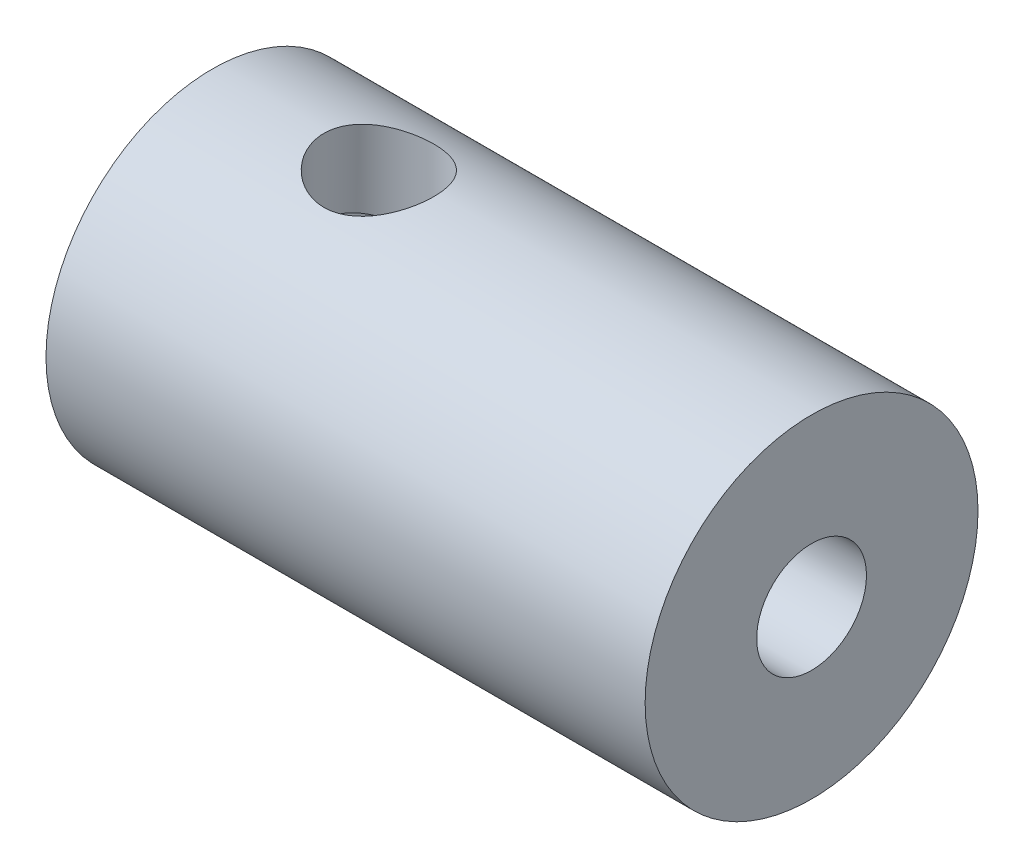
ISO-10303-21;
HEADER;
FILE_DESCRIPTION(('STEP AP214'),'2;1');
FILE_NAME('part.step','',(''),(''),'','','');
FILE_SCHEMA(('AUTOMOTIVE_DESIGN { 1 0 10303 214 1 1 1 1 }'));
ENDSEC;
DATA;
#1=APPLICATION_CONTEXT('core data for automotive mechanical design processes');
#2=APPLICATION_PROTOCOL_DEFINITION('international standard','automotive_design',2000,#1);
#3=PRODUCT_CONTEXT('',#1,'mechanical');
#4=PRODUCT('Part','Part','',(#3));
#5=PRODUCT_RELATED_PRODUCT_CATEGORY('part','',(#4));
#6=PRODUCT_DEFINITION_FORMATION('','',#4);
#7=PRODUCT_DEFINITION_CONTEXT('part definition',#1,'design');
#8=PRODUCT_DEFINITION('design','',#6,#7);
#9=PRODUCT_DEFINITION_SHAPE('','',#8);
#10=(LENGTH_UNIT() NAMED_UNIT(*) SI_UNIT(.MILLI.,.METRE.));
#11=(NAMED_UNIT(*) PLANE_ANGLE_UNIT() SI_UNIT($,.RADIAN.));
#12=(NAMED_UNIT(*) SI_UNIT($,.STERADIAN.) SOLID_ANGLE_UNIT());
#13=UNCERTAINTY_MEASURE_WITH_UNIT(LENGTH_MEASURE(1.E-05),#10,'distance_accuracy_value','');
#14=(GEOMETRIC_REPRESENTATION_CONTEXT(3) GLOBAL_UNCERTAINTY_ASSIGNED_CONTEXT((#13)) GLOBAL_UNIT_ASSIGNED_CONTEXT((#10,
#11,#12)) REPRESENTATION_CONTEXT('',''));
#15=CARTESIAN_POINT('',(0.,0.,0.));
#16=DIRECTION('',(0.,0.,1.));
#17=DIRECTION('',(1.,0.,0.));
#18=AXIS2_PLACEMENT_3D('',#15,#16,#17);
#19=CARTESIAN_POINT('',(18.,0.,0.));
#20=DIRECTION('',(-1.,0.,0.));
#21=DIRECTION('',(0.,0.,1.));
#22=AXIS2_PLACEMENT_3D('',#19,#20,#21);
#23=CYLINDRICAL_SURFACE('',#22,5.);
#24=CARTESIAN_POINT('',(5.,-4.71990466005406,1.64999999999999));
#25=CARTESIAN_POINT('',(5.08992939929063,-4.71990452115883,1.65000024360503));
#26=CARTESIAN_POINT('',(5.17985768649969,-4.72250292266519,1.64262303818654));
#27=CARTESIAN_POINT('',(5.35705367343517,-4.73256311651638,1.61340616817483));
#28=CARTESIAN_POINT('',(5.44432088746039,-4.74002579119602,1.59156387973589));
#29=CARTESIAN_POINT('',(5.61359969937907,-4.75887919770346,1.53426465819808));
#30=CARTESIAN_POINT('',(5.69562107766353,-4.77026235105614,1.49883397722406));
#31=CARTESIAN_POINT('',(5.8525814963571,-4.79566317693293,1.41545303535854));
#32=CARTESIAN_POINT('',(5.92751901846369,-4.80968141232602,1.36750009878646));
#33=CARTESIAN_POINT('',(6.07105763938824,-4.83937566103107,1.25846654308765));
#34=CARTESIAN_POINT('',(6.13934748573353,-4.85509238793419,1.1969871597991));
#35=CARTESIAN_POINT('',(6.26485926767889,-4.88606822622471,1.06349727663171));
#36=CARTESIAN_POINT('',(6.322079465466,-4.90132726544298,0.991485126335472));
#37=CARTESIAN_POINT('',(6.42523358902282,-4.93013890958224,0.836704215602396));
#38=CARTESIAN_POINT('',(6.47084230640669,-4.94363804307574,0.75370788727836));
#39=CARTESIAN_POINT('',(6.54732873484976,-4.9669298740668,0.580699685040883));
#40=CARTESIAN_POINT('',(6.57821033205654,-4.97672354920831,0.490689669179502));
#41=CARTESIAN_POINT('',(6.62331307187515,-4.99121262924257,0.309471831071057));
#42=CARTESIAN_POINT('',(6.63806721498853,-4.99607073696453,0.218409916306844));
#43=CARTESIAN_POINT('',(6.65218999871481,-5.00071837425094,0.0349820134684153));
#44=CARTESIAN_POINT('',(6.65156252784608,-5.00050918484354,-0.0573836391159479));
#45=CARTESIAN_POINT('',(6.63528002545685,-4.99515654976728,-0.237027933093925));
#46=CARTESIAN_POINT('',(6.6202037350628,-4.99020313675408,-0.324365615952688));
#47=CARTESIAN_POINT('',(6.5764073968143,-4.9761564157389,-0.49519357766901));
#48=CARTESIAN_POINT('',(6.54768642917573,-4.96706282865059,-0.578683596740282));
#49=CARTESIAN_POINT('',(6.47707262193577,-4.94551338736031,-0.740723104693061));
#50=CARTESIAN_POINT('',(6.43501331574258,-4.93301533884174,-0.819194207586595));
#51=CARTESIAN_POINT('',(6.33905332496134,-4.90596050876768,-0.968137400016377));
#52=CARTESIAN_POINT('',(6.28514939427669,-4.89140316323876,-1.03860728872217));
#53=CARTESIAN_POINT('',(6.16410482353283,-4.86097294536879,-1.1729917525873));
#54=CARTESIAN_POINT('',(6.09646769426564,-4.84507036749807,-1.23645304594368));
#55=CARTESIAN_POINT('',(5.95137341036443,-4.81431124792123,-1.35127700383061));
#56=CARTESIAN_POINT('',(5.87391480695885,-4.79945486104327,-1.4026378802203));
#57=CARTESIAN_POINT('',(5.70996560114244,-4.77230967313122,-1.49241382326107));
#58=CARTESIAN_POINT('',(5.62336561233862,-4.76005891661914,-1.53064150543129));
#59=CARTESIAN_POINT('',(5.44445239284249,-4.73995346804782,-1.59181981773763));
#60=CARTESIAN_POINT('',(5.35214151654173,-4.73209697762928,-1.61477669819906));
#61=CARTESIAN_POINT('',(5.16880983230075,-4.72207527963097,-1.6438468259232));
#62=CARTESIAN_POINT('',(5.0779131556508,-4.71967327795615,-1.65066145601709));
#63=CARTESIAN_POINT('',(4.89626215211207,-4.7201713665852,-1.64923749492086));
#64=CARTESIAN_POINT('',(4.80550780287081,-4.72307051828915,-1.64100156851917));
#65=CARTESIAN_POINT('',(4.62987992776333,-4.73360855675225,-1.61033997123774));
#66=CARTESIAN_POINT('',(4.54491123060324,-4.74108573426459,-1.5883979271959));
#67=CARTESIAN_POINT('',(4.37987739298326,-4.75976051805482,-1.53152522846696));
#68=CARTESIAN_POINT('',(4.2998131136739,-4.77095877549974,-1.49659230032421));
#69=CARTESIAN_POINT('',(4.14408997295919,-4.79624726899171,-1.41348842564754));
#70=CARTESIAN_POINT('',(4.06864683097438,-4.81041691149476,-1.36493806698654));
#71=CARTESIAN_POINT('',(3.92672439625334,-4.83989585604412,-1.25640957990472));
#72=CARTESIAN_POINT('',(3.86024770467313,-4.85520548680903,-1.19642814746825));
#73=CARTESIAN_POINT('',(3.73491681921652,-4.88610989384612,-1.06339123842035));
#74=CARTESIAN_POINT('',(3.67656776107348,-4.90168425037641,-0.989853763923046));
#75=CARTESIAN_POINT('',(3.57300735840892,-4.93065204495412,-0.833649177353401));
#76=CARTESIAN_POINT('',(3.52779552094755,-4.94404556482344,-0.750982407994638));
#77=CARTESIAN_POINT('',(3.45221100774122,-4.96707750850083,-0.579295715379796));
#78=CARTESIAN_POINT('',(3.42173954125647,-4.976740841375,-0.490322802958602));
#79=CARTESIAN_POINT('',(3.37631330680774,-4.99133146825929,-0.308134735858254));
#80=CARTESIAN_POINT('',(3.36135306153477,-4.99626043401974,-0.214921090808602));
#81=CARTESIAN_POINT('',(3.34785918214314,-5.00070328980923,-0.0315225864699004));
#82=CARTESIAN_POINT('',(3.34859968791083,-5.00045646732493,0.0586036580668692));
#83=CARTESIAN_POINT('',(3.36470152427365,-4.99516201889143,0.23738802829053));
#84=CARTESIAN_POINT('',(3.38006170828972,-4.99011476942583,0.326046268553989));
#85=CARTESIAN_POINT('',(3.42448830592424,-4.97587240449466,0.498029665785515));
#86=CARTESIAN_POINT('',(3.45334133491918,-4.96674195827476,0.581415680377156));
#87=CARTESIAN_POINT('',(3.52373789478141,-4.94527347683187,0.742196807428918));
#88=CARTESIAN_POINT('',(3.56528370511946,-4.93293486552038,0.819590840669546));
#89=CARTESIAN_POINT('',(3.66163265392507,-4.90576374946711,0.969268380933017));
#90=CARTESIAN_POINT('',(3.71686414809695,-4.8908566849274,1.04126244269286));
#91=CARTESIAN_POINT('',(3.8382836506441,-4.86041514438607,1.17519818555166));
#92=CARTESIAN_POINT('',(3.90447511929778,-4.84488047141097,1.23713667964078));
#93=CARTESIAN_POINT('',(4.04895585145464,-4.81423121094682,1.35160179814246));
#94=CARTESIAN_POINT('',(4.12761026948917,-4.79915525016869,1.40367929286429));
#95=CARTESIAN_POINT('',(4.29302166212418,-4.77186368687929,1.49383628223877));
#96=CARTESIAN_POINT('',(4.37977631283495,-4.759647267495,1.5319197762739));
#97=CARTESIAN_POINT('',(4.55434327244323,-4.74014636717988,1.59120734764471));
#98=CARTESIAN_POINT('',(4.64186804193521,-4.7326392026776,1.61318355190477));
#99=CARTESIAN_POINT('',(4.81959617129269,-4.7225192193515,1.64257737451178));
#100=CARTESIAN_POINT('',(4.90979864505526,-4.71990479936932,1.64999975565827));
#101=CARTESIAN_POINT('',(5.,-4.71990466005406,1.64999999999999));
#102=B_SPLINE_CURVE_WITH_KNOTS('',3,(#24,#25,#26,#27,#28,#29,#30,#31,#32,#33,#34,#35,#36,#37,
#38,#39,#40,#41,#42,#43,#44,#45,#46,#47,#48,#49,#50,#51,#52,#53,#54,#55,#56,#57,#58,#59,#60,#61,
#62,#63,#64,#65,#66,#67,#68,#69,#70,#71,#72,#73,#74,#75,#76,#77,#78,#79,#80,#81,#82,#83,#84,#85,
#86,#87,#88,#89,#90,#91,#92,#93,#94,#95,#96,#97,#98,#99,#100,#101),.UNSPECIFIED.,.T.,.F.,(4,2,2,
2,2,2,2,2,2,2,2,2,2,2,2,2,2,2,2,2,2,2,2,2,2,2,2,2,2,2,2,2,2,2,2,2,2,2,4),(0.,0.269454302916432,
0.538957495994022,0.807942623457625,1.07698527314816,1.35539043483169,1.63383926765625,
1.91939248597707,2.20487031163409,2.48059787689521,2.75625573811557,3.02131448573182,
3.28639110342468,3.55491555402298,3.82351368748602,4.10452131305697,4.38557043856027,
4.67047751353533,4.95526790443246,5.22743703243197,5.49955797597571,5.76258081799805,
6.02564971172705,6.29693565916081,6.56830013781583,6.85241935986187,7.13652791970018,
7.41870503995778,7.70078248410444,7.96984890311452,8.23889422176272,8.50382155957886,
8.76879650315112,9.04343817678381,9.3181667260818,9.60337461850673,9.8885009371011,
10.1588585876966,10.4291277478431),.UNSPECIFIED.);
#103=CARTESIAN_POINT('',(5.,-4.71990466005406,1.64999999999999));
#104=VERTEX_POINT('',#103);
#105=EDGE_CURVE('E51',#104,#104,#102,.T.);
#106=ORIENTED_EDGE('',*,*,#105,.T.);
#107=EDGE_LOOP('',(#106));
#108=FACE_BOUND('',#107,.T.);
#109=CARTESIAN_POINT('',(5.,4.71990466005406,1.64999999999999));
#110=CARTESIAN_POINT('',(4.91007060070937,4.71990452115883,1.65000024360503));
#111=CARTESIAN_POINT('',(4.82014231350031,4.72250292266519,1.64262303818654));
#112=CARTESIAN_POINT('',(4.64294632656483,4.73256311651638,1.61340616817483));
#113=CARTESIAN_POINT('',(4.55567911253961,4.74002579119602,1.59156387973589));
#114=CARTESIAN_POINT('',(4.38640030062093,4.75887919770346,1.53426465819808));
#115=CARTESIAN_POINT('',(4.30437892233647,4.77026235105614,1.49883397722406));
#116=CARTESIAN_POINT('',(4.1474185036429,4.79566317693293,1.41545303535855));
#117=CARTESIAN_POINT('',(4.07248098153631,4.80968141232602,1.36750009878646));
#118=CARTESIAN_POINT('',(3.92894236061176,4.83937566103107,1.25846654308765));
#119=CARTESIAN_POINT('',(3.86065251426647,4.85509238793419,1.1969871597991));
#120=CARTESIAN_POINT('',(3.73514073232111,4.88606822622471,1.06349727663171));
#121=CARTESIAN_POINT('',(3.677920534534,4.90132726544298,0.991485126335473));
#122=CARTESIAN_POINT('',(3.57476641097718,4.93013890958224,0.836704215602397));
#123=CARTESIAN_POINT('',(3.52915769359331,4.94363804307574,0.753707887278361));
#124=CARTESIAN_POINT('',(3.45267126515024,4.9669298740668,0.580699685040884));
#125=CARTESIAN_POINT('',(3.42178966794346,4.97672354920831,0.490689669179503));
#126=CARTESIAN_POINT('',(3.37668692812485,4.99121262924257,0.309471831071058));
#127=CARTESIAN_POINT('',(3.36193278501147,4.99607073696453,0.218409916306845));
#128=CARTESIAN_POINT('',(3.34781000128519,5.00071837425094,0.0349820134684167));
#129=CARTESIAN_POINT('',(3.34843747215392,5.00050918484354,-0.0573836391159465));
#130=CARTESIAN_POINT('',(3.36471997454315,4.99515654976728,-0.237027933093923));
#131=CARTESIAN_POINT('',(3.3797962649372,4.99020313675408,-0.324365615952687));
#132=CARTESIAN_POINT('',(3.4235926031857,4.9761564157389,-0.495193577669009));
#133=CARTESIAN_POINT('',(3.45231357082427,4.96706282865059,-0.578683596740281));
#134=CARTESIAN_POINT('',(3.52292737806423,4.94551338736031,-0.74072310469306));
#135=CARTESIAN_POINT('',(3.56498668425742,4.93301533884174,-0.819194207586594));
#136=CARTESIAN_POINT('',(3.66094667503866,4.90596050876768,-0.968137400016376));
#137=CARTESIAN_POINT('',(3.71485060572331,4.89140316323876,-1.03860728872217));
#138=CARTESIAN_POINT('',(3.83589517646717,4.86097294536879,-1.1729917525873));
#139=CARTESIAN_POINT('',(3.90353230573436,4.84507036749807,-1.23645304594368));
#140=CARTESIAN_POINT('',(4.04862658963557,4.81431124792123,-1.35127700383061));
#141=CARTESIAN_POINT('',(4.12608519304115,4.79945486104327,-1.40263788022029));
#142=CARTESIAN_POINT('',(4.29003439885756,4.77230967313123,-1.49241382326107));
#143=CARTESIAN_POINT('',(4.37663438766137,4.76005891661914,-1.53064150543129));
#144=CARTESIAN_POINT('',(4.55554760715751,4.73995346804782,-1.59181981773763));
#145=CARTESIAN_POINT('',(4.64785848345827,4.73209697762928,-1.61477669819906));
#146=CARTESIAN_POINT('',(4.83119016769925,4.72207527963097,-1.6438468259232));
#147=CARTESIAN_POINT('',(4.92208684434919,4.71967327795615,-1.65066145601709));
#148=CARTESIAN_POINT('',(5.10373784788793,4.7201713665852,-1.64923749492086));
#149=CARTESIAN_POINT('',(5.19449219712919,4.72307051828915,-1.64100156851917));
#150=CARTESIAN_POINT('',(5.37012007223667,4.73360855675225,-1.61033997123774));
#151=CARTESIAN_POINT('',(5.45508876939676,4.74108573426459,-1.5883979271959));
#152=CARTESIAN_POINT('',(5.62012260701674,4.75976051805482,-1.53152522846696));
#153=CARTESIAN_POINT('',(5.7001868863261,4.77095877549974,-1.49659230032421));
#154=CARTESIAN_POINT('',(5.85591002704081,4.79624726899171,-1.41348842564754));
#155=CARTESIAN_POINT('',(5.93135316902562,4.81041691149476,-1.36493806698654));
#156=CARTESIAN_POINT('',(6.07327560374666,4.83989585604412,-1.25640957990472));
#157=CARTESIAN_POINT('',(6.13975229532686,4.85520548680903,-1.19642814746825));
#158=CARTESIAN_POINT('',(6.26508318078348,4.88610989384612,-1.06339123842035));
#159=CARTESIAN_POINT('',(6.32343223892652,4.90168425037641,-0.989853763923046));
#160=CARTESIAN_POINT('',(6.42699264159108,4.93065204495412,-0.833649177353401));
#161=CARTESIAN_POINT('',(6.47220447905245,4.94404556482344,-0.750982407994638));
#162=CARTESIAN_POINT('',(6.54778899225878,4.96707750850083,-0.579295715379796));
#163=CARTESIAN_POINT('',(6.57826045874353,4.976740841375,-0.490322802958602));
#164=CARTESIAN_POINT('',(6.62368669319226,4.99133146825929,-0.308134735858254));
#165=CARTESIAN_POINT('',(6.63864693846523,4.99626043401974,-0.214921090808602));
#166=CARTESIAN_POINT('',(6.65214081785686,5.00070328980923,-0.0315225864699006));
#167=CARTESIAN_POINT('',(6.65140031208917,5.00045646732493,0.0586036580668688));
#168=CARTESIAN_POINT('',(6.63529847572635,4.99516201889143,0.23738802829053));
#169=CARTESIAN_POINT('',(6.61993829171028,4.99011476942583,0.326046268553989));
#170=CARTESIAN_POINT('',(6.57551169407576,4.97587240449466,0.498029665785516));
#171=CARTESIAN_POINT('',(6.54665866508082,4.96674195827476,0.581415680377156));
#172=CARTESIAN_POINT('',(6.47626210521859,4.94527347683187,0.742196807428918));
#173=CARTESIAN_POINT('',(6.43471629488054,4.93293486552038,0.819590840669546));
#174=CARTESIAN_POINT('',(6.33836734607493,4.90576374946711,0.969268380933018));
#175=CARTESIAN_POINT('',(6.28313585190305,4.8908566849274,1.04126244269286));
#176=CARTESIAN_POINT('',(6.1617163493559,4.86041514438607,1.17519818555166));
#177=CARTESIAN_POINT('',(6.09552488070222,4.84488047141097,1.23713667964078));
#178=CARTESIAN_POINT('',(5.95104414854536,4.81423121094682,1.35160179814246));
#179=CARTESIAN_POINT('',(5.87238973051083,4.79915525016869,1.40367929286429));
#180=CARTESIAN_POINT('',(5.70697833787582,4.77186368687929,1.49383628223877));
#181=CARTESIAN_POINT('',(5.62022368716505,4.759647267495,1.5319197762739));
#182=CARTESIAN_POINT('',(5.44565672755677,4.74014636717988,1.59120734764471));
#183=CARTESIAN_POINT('',(5.35813195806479,4.7326392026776,1.61318355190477));
#184=CARTESIAN_POINT('',(5.18040382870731,4.7225192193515,1.64257737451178));
#185=CARTESIAN_POINT('',(5.09020135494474,4.71990479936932,1.64999975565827));
#186=CARTESIAN_POINT('',(5.,4.71990466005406,1.64999999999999));
#187=B_SPLINE_CURVE_WITH_KNOTS('',3,(#109,#110,#111,#112,#113,#114,#115,#116,#117,#118,#119,
#120,#121,#122,#123,#124,#125,#126,#127,#128,#129,#130,#131,#132,#133,#134,#135,#136,#137,#138,
#139,#140,#141,#142,#143,#144,#145,#146,#147,#148,#149,#150,#151,#152,#153,#154,#155,#156,#157,
#158,#159,#160,#161,#162,#163,#164,#165,#166,#167,#168,#169,#170,#171,#172,#173,#174,#175,#176,
#177,#178,#179,#180,#181,#182,#183,#184,#185,#186),.UNSPECIFIED.,.T.,.F.,(4,2,2,2,2,2,2,2,2,2,2,
2,2,2,2,2,2,2,2,2,2,2,2,2,2,2,2,2,2,2,2,2,2,2,2,2,2,2,4),(0.,0.269454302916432,
0.538957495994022,0.807942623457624,1.07698527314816,1.35539043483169,1.63383926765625,
1.91939248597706,2.20487031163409,2.48059787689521,2.75625573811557,3.02131448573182,
3.28639110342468,3.55491555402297,3.82351368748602,4.10452131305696,4.38557043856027,
4.67047751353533,4.95526790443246,5.22743703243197,5.49955797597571,5.76258081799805,
6.02564971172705,6.29693565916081,6.56830013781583,6.85241935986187,7.13652791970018,
7.41870503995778,7.70078248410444,7.96984890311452,8.23889422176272,8.50382155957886,
8.76879650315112,9.04343817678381,9.3181667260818,9.60337461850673,9.8885009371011,
10.1588585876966,10.4291277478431),.UNSPECIFIED.);
#188=CARTESIAN_POINT('',(5.,4.71990466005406,1.64999999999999));
#189=VERTEX_POINT('',#188);
#190=EDGE_CURVE('E12',#189,#189,#187,.T.);
#191=ORIENTED_EDGE('',*,*,#190,.T.);
#192=EDGE_LOOP('',(#191));
#193=FACE_BOUND('',#192,.T.);
#194=CARTESIAN_POINT('',(18.,0.,0.));
#195=DIRECTION('',(1.,0.,0.));
#196=DIRECTION('',(0.,0.,-1.));
#197=AXIS2_PLACEMENT_3D('',#194,#195,#196);
#198=CIRCLE('',#197,5.);
#199=CARTESIAN_POINT('',(18.,0.,-5.));
#200=VERTEX_POINT('',#199);
#201=EDGE_CURVE('E58',#200,#200,#198,.T.);
#202=ORIENTED_EDGE('',*,*,#201,.F.);
#203=EDGE_LOOP('',(#202));
#204=FACE_BOUND('',#203,.T.);
#205=CARTESIAN_POINT('',(0.,0.,0.));
#206=DIRECTION('',(1.,0.,0.));
#207=DIRECTION('',(0.,0.,-1.));
#208=AXIS2_PLACEMENT_3D('',#205,#206,#207);
#209=CIRCLE('',#208,5.);
#210=CARTESIAN_POINT('',(0.,0.,-5.));
#211=VERTEX_POINT('',#210);
#212=EDGE_CURVE('E62',#211,#211,#209,.T.);
#213=ORIENTED_EDGE('',*,*,#212,.T.);
#214=EDGE_LOOP('',(#213));
#215=FACE_BOUND('',#214,.T.);
#216=ADVANCED_FACE('F47',(#108,#193,#204,#215),#23,.T.);
#217=CARTESIAN_POINT('',(18.,0.,0.));
#218=DIRECTION('',(1.,0.,0.));
#219=DIRECTION('',(0.,0.,-1.));
#220=AXIS2_PLACEMENT_3D('',#217,#218,#219);
#221=PLANE('',#220);
#222=CARTESIAN_POINT('',(18.,0.,0.));
#223=DIRECTION('',(1.,0.,0.));
#224=DIRECTION('',(0.,0.,-1.));
#225=AXIS2_PLACEMENT_3D('',#222,#223,#224);
#226=CIRCLE('',#225,1.64999999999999);
#227=CARTESIAN_POINT('',(18.,0.,-1.64999999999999));
#228=VERTEX_POINT('',#227);
#229=EDGE_CURVE('E98',#228,#228,#226,.T.);
#230=ORIENTED_EDGE('',*,*,#229,.F.);
#231=EDGE_LOOP('',(#230));
#232=FACE_BOUND('',#231,.T.);
#233=ORIENTED_EDGE('',*,*,#201,.T.);
#234=EDGE_LOOP('',(#233));
#235=FACE_BOUND('',#234,.T.);
#236=ADVANCED_FACE('F107',(#232,#235),#221,.T.);
#237=CARTESIAN_POINT('',(0.,0.,0.));
#238=DIRECTION('',(1.,0.,0.));
#239=DIRECTION('',(0.,0.,-1.));
#240=AXIS2_PLACEMENT_3D('',#237,#238,#239);
#241=PLANE('',#240);
#242=CARTESIAN_POINT('',(0.,0.,0.));
#243=DIRECTION('',(-1.,0.,0.));
#244=DIRECTION('',(0.,0.,1.));
#245=AXIS2_PLACEMENT_3D('',#242,#243,#244);
#246=CIRCLE('',#245,2.74999999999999);
#247=CARTESIAN_POINT('',(0.,0.,2.74999999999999));
#248=VERTEX_POINT('',#247);
#249=EDGE_CURVE('E92',#248,#248,#246,.T.);
#250=ORIENTED_EDGE('',*,*,#249,.F.);
#251=EDGE_LOOP('',(#250));
#252=FACE_BOUND('',#251,.T.);
#253=ORIENTED_EDGE('',*,*,#212,.F.);
#254=EDGE_LOOP('',(#253));
#255=FACE_BOUND('',#254,.T.);
#256=ADVANCED_FACE('F104',(#252,#255),#241,.F.);
#257=CARTESIAN_POINT('',(18.,0.,0.));
#258=DIRECTION('',(1.,0.,0.));
#259=DIRECTION('',(0.,0.,-1.));
#260=AXIS2_PLACEMENT_3D('',#257,#258,#259);
#261=CYLINDRICAL_SURFACE('',#260,1.64999999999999);
#262=CARTESIAN_POINT('',(10.6609466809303,0.,0.));
#263=DIRECTION('',(-1.,0.,0.));
#264=DIRECTION('',(0.,0.,1.));
#265=AXIS2_PLACEMENT_3D('',#262,#263,#264);
#266=CIRCLE('',#265,1.64999999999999);
#267=CARTESIAN_POINT('',(10.6609466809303,0.,1.64999999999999));
#268=VERTEX_POINT('',#267);
#269=EDGE_CURVE('E67',#268,#268,#266,.T.);
#270=ORIENTED_EDGE('',*,*,#269,.T.);
#271=EDGE_LOOP('',(#270));
#272=FACE_BOUND('',#271,.T.);
#273=ORIENTED_EDGE('',*,*,#229,.T.);
#274=EDGE_LOOP('',(#273));
#275=FACE_BOUND('',#274,.T.);
#276=ADVANCED_FACE('F106',(#272,#275),#261,.F.);
#277=CARTESIAN_POINT('',(10.,0.,0.));
#278=DIRECTION('',(-1.,0.,0.));
#279=DIRECTION('',(0.,0.,1.));
#280=AXIS2_PLACEMENT_3D('',#277,#278,#279);
#281=CONICAL_SURFACE('',#280,2.75,1.02974425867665);
#282=CARTESIAN_POINT('',(10.,0.,0.));
#283=DIRECTION('',(-1.,0.,0.));
#284=DIRECTION('',(0.,0.,1.));
#285=AXIS2_PLACEMENT_3D('',#282,#283,#284);
#286=CIRCLE('',#285,2.75);
#287=CARTESIAN_POINT('',(10.,0.,2.75));
#288=VERTEX_POINT('',#287);
#289=EDGE_CURVE('E95',#288,#288,#286,.T.);
#290=ORIENTED_EDGE('',*,*,#289,.T.);
#291=EDGE_LOOP('',(#290));
#292=FACE_BOUND('',#291,.T.);
#293=ORIENTED_EDGE('',*,*,#269,.F.);
#294=EDGE_LOOP('',(#293));
#295=FACE_BOUND('',#294,.T.);
#296=ADVANCED_FACE('F113',(#292,#295),#281,.F.);
#297=CARTESIAN_POINT('',(0.,0.,0.));
#298=DIRECTION('',(-1.,0.,0.));
#299=DIRECTION('',(0.,0.,1.));
#300=AXIS2_PLACEMENT_3D('',#297,#298,#299);
#301=CYLINDRICAL_SURFACE('',#300,2.74999999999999);
#302=CARTESIAN_POINT('',(5.,-2.2,1.64999999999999));
#303=CARTESIAN_POINT('',(4.9169731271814,-2.19999358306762,1.6500044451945));
#304=CARTESIAN_POINT('',(4.83396772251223,-2.20476997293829,1.64369538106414));
#305=CARTESIAN_POINT('',(4.67074370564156,-2.22301849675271,1.61892461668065));
#306=CARTESIAN_POINT('',(4.59052809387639,-2.23649970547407,1.60045023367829));
#307=CARTESIAN_POINT('',(4.435607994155,-2.26998572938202,1.55257834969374));
#308=CARTESIAN_POINT('',(4.36086827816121,-2.28994332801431,1.52325969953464));
#309=CARTESIAN_POINT('',(4.21741880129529,-2.33404495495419,1.45478200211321));
#310=CARTESIAN_POINT('',(4.14871084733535,-2.35819023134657,1.41562001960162));
#311=CARTESIAN_POINT('',(4.01005608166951,-2.41151454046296,1.32298422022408));
#312=CARTESIAN_POINT('',(3.94098494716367,-2.44094808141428,1.26834597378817));
#313=CARTESIAN_POINT('',(3.81225876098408,-2.49948852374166,1.14869481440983));
#314=CARTESIAN_POINT('',(3.75261083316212,-2.52859516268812,1.08367412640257));
#315=CARTESIAN_POINT('',(3.63805280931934,-2.58693124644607,0.936586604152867));
#316=CARTESIAN_POINT('',(3.58435008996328,-2.61583446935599,0.853437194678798));
#317=CARTESIAN_POINT('',(3.49210930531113,-2.66688165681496,0.67721965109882));
#318=CARTESIAN_POINT('',(3.45355732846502,-2.68903181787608,0.58416071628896));
#319=CARTESIAN_POINT('',(3.39664448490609,-2.72218086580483,0.40014854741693));
#320=CARTESIAN_POINT('',(3.37670760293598,-2.73404234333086,0.309842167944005));
#321=CARTESIAN_POINT('',(3.35226291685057,-2.74862433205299,0.126467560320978));
#322=CARTESIAN_POINT('',(3.34774062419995,-2.75135342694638,0.0334020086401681));
#323=CARTESIAN_POINT('',(3.35397512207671,-2.74761709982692,-0.140401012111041));
#324=CARTESIAN_POINT('',(3.36290687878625,-2.74224981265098,-0.221236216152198));
#325=CARTESIAN_POINT('',(3.39232777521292,-2.72478797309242,-0.380010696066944));
#326=CARTESIAN_POINT('',(3.41281777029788,-2.71269292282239,-0.45794975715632));
#327=CARTESIAN_POINT('',(3.46458211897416,-2.68273397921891,-0.609462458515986));
#328=CARTESIAN_POINT('',(3.4959183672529,-2.66483701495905,-0.683008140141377));
#329=CARTESIAN_POINT('',(3.5682230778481,-2.62470601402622,-0.823887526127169));
#330=CARTESIAN_POINT('',(3.60919404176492,-2.60247085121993,-0.891219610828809));
#331=CARTESIAN_POINT('',(3.7051230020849,-2.55241718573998,-1.02638169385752));
#332=CARTESIAN_POINT('',(3.76116714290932,-2.52424901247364,-1.09331052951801));
#333=CARTESIAN_POINT('',(3.8828445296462,-2.46681109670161,-1.21738612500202));
#334=CARTESIAN_POINT('',(3.94849075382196,-2.43753990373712,-1.27451941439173));
#335=CARTESIAN_POINT('',(4.09651874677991,-2.3772218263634,-1.38407321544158));
#336=CARTESIAN_POINT('',(4.17995833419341,-2.34636227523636,-1.43518026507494));
#337=CARTESIAN_POINT('',(4.35617685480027,-2.29075967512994,-1.52236938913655));
#338=CARTESIAN_POINT('',(4.44893818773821,-2.26600539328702,-1.55847914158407));
#339=CARTESIAN_POINT('',(4.61763299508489,-2.23185451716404,-1.60685246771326));
#340=CARTESIAN_POINT('',(4.69204469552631,-2.22017277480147,-1.62280693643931));
#341=CARTESIAN_POINT('',(4.84311097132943,-2.20431365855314,-1.64428960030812));
#342=CARTESIAN_POINT('',(4.91976283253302,-2.20012755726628,-1.64982992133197));
#343=CARTESIAN_POINT('',(5.07320685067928,-2.19987805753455,-1.650162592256));
#344=CARTESIAN_POINT('',(5.14999905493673,-2.20382591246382,-1.64494005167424));
#345=CARTESIAN_POINT('',(5.30138607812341,-2.21926672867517,-1.62404319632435));
#346=CARTESIAN_POINT('',(5.37597911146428,-2.23076565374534,-1.60836062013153));
#347=CARTESIAN_POINT('',(5.52108603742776,-2.2597494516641,-1.56737143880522));
#348=CARTESIAN_POINT('',(5.59160490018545,-2.27722684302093,-1.54207685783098));
#349=CARTESIAN_POINT('',(5.7276254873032,-2.31628693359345,-1.48275887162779));
#350=CARTESIAN_POINT('',(5.7931253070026,-2.33787118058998,-1.44873217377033));
#351=CARTESIAN_POINT('',(5.92976409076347,-2.3874050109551,-1.36584183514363));
#352=CARTESIAN_POINT('',(5.99979091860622,-2.41580063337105,-1.31540929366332));
#353=CARTESIAN_POINT('',(6.1311140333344,-2.47303930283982,-1.2043613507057));
#354=CARTESIAN_POINT('',(6.19240186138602,-2.501882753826,-1.14373620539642));
#355=CARTESIAN_POINT('',(6.31254640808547,-2.56119188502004,-1.00460232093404));
#356=CARTESIAN_POINT('',(6.37005079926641,-2.59138083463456,-0.924793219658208));
#357=CARTESIAN_POINT('',(6.47059305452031,-2.64591403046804,-0.75471341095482));
#358=CARTESIAN_POINT('',(6.51364051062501,-2.67026214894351,-0.664449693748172));
#359=CARTESIAN_POINT('',(6.5805550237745,-2.70877508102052,-0.482724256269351));
#360=CARTESIAN_POINT('',(6.60558885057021,-2.72355146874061,-0.391826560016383));
#361=CARTESIAN_POINT('',(6.63978606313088,-2.74384812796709,-0.206121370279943));
#362=CARTESIAN_POINT('',(6.64896741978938,-2.7493788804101,-0.111318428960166));
#363=CARTESIAN_POINT('',(6.65074206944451,-2.75044660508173,0.0657932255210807));
#364=CARTESIAN_POINT('',(6.64538366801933,-2.74721762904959,0.148082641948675));
#365=CARTESIAN_POINT('',(6.62261679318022,-2.73364243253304,0.310363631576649));
#366=CARTESIAN_POINT('',(6.60520818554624,-2.72329613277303,0.390355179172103));
#367=CARTESIAN_POINT('',(6.55955847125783,-2.69664370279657,0.544660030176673));
#368=CARTESIAN_POINT('',(6.53149524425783,-2.68043563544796,0.619043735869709));
#369=CARTESIAN_POINT('',(6.46559534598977,-2.6433367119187,0.762060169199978));
#370=CARTESIAN_POINT('',(6.42775648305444,-2.62244480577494,0.830691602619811));
#371=CARTESIAN_POINT('',(6.33878228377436,-2.57502775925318,0.968290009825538));
#372=CARTESIAN_POINT('',(6.28664942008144,-2.54813729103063,1.03648455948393));
#373=CARTESIAN_POINT('',(6.1728716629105,-2.49262098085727,1.16368726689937));
#374=CARTESIAN_POINT('',(6.1112162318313,-2.46399323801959,1.22268510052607));
#375=CARTESIAN_POINT('',(5.97098588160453,-2.40380982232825,1.33750072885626));
#376=CARTESIAN_POINT('',(5.89125686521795,-2.37234322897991,1.39196647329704));
#377=CARTESIAN_POINT('',(5.7221666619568,-2.31414110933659,1.48672498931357));
#378=CARTESIAN_POINT('',(5.63281051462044,-2.28740312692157,1.52702512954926));
#379=CARTESIAN_POINT('',(5.45422928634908,-2.24488003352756,1.58880828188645));
#380=CARTESIAN_POINT('',(5.36564524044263,-2.22835432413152,1.61160478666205));
#381=CARTESIAN_POINT('',(5.18469286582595,-2.2059293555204,1.64218195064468));
#382=CARTESIAN_POINT('',(5.09233315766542,-2.20000713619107,1.6499950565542));
#383=CARTESIAN_POINT('',(5.,-2.2,1.64999999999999));
#384=B_SPLINE_CURVE_WITH_KNOTS('',3,(#302,#303,#304,#305,#306,#307,#308,#309,#310,#311,#312,
#313,#314,#315,#316,#317,#318,#319,#320,#321,#322,#323,#324,#325,#326,#327,#328,#329,#330,#331,
#332,#333,#334,#335,#336,#337,#338,#339,#340,#341,#342,#343,#344,#345,#346,#347,#348,#349,#350,
#351,#352,#353,#354,#355,#356,#357,#358,#359,#360,#361,#362,#363,#364,#365,#366,#367,#368,#369,
#370,#371,#372,#373,#374,#375,#376,#377,#378,#379,#380,#381,#382,#383),.UNSPECIFIED.,.T.,.F.,(4,
2,2,2,2,2,2,2,2,2,2,2,2,2,2,2,2,2,2,2,2,2,2,2,2,2,2,2,2,2,2,2,2,2,2,2,2,2,2,2,4),(0.,
0.24869377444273,0.497647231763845,0.74482498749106,0.992076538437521,1.26955908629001,
1.54725041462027,1.85493173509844,2.16232987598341,2.44038663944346,2.71818197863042,
2.96153143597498,3.20489890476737,3.44967870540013,3.69452213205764,3.96861091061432,
4.24307363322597,4.54934338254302,4.85504536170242,5.0850392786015,5.31476523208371,
5.54480922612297,5.77503512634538,6.00497396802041,6.23499964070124,6.50649382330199,
6.77824903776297,7.08534010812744,7.39222702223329,7.67680627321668,7.96106270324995,
8.20742254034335,8.45378512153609,8.69620367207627,8.93867661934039,9.20747259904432,
9.47656818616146,9.7797886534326,10.0828511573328,10.3600213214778,10.636590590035),.UNSPECIFIED.);
#385=CARTESIAN_POINT('',(5.,-2.2,1.64999999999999));
#386=VERTEX_POINT('',#385);
#387=EDGE_CURVE('E87',#386,#386,#384,.T.);
#388=ORIENTED_EDGE('',*,*,#387,.T.);
#389=EDGE_LOOP('',(#388));
#390=FACE_BOUND('',#389,.T.);
#391=CARTESIAN_POINT('',(5.,2.2,1.64999999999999));
#392=CARTESIAN_POINT('',(5.0830268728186,2.19999358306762,1.6500044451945));
#393=CARTESIAN_POINT('',(5.16603227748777,2.20476997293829,1.64369538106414));
#394=CARTESIAN_POINT('',(5.32925629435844,2.22301849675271,1.61892461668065));
#395=CARTESIAN_POINT('',(5.40947190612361,2.23649970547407,1.60045023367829));
#396=CARTESIAN_POINT('',(5.564392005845,2.26998572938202,1.55257834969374));
#397=CARTESIAN_POINT('',(5.63913172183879,2.28994332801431,1.52325969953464));
#398=CARTESIAN_POINT('',(5.78258119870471,2.33404495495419,1.45478200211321));
#399=CARTESIAN_POINT('',(5.85128915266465,2.35819023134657,1.41562001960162));
#400=CARTESIAN_POINT('',(5.98994391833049,2.41151454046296,1.32298422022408));
#401=CARTESIAN_POINT('',(6.05901505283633,2.44094808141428,1.26834597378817));
#402=CARTESIAN_POINT('',(6.18774123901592,2.49948852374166,1.14869481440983));
#403=CARTESIAN_POINT('',(6.24738916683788,2.52859516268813,1.08367412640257));
#404=CARTESIAN_POINT('',(6.36194719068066,2.58693124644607,0.936586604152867));
#405=CARTESIAN_POINT('',(6.41564991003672,2.61583446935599,0.853437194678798));
#406=CARTESIAN_POINT('',(6.50789069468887,2.66688165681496,0.677219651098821));
#407=CARTESIAN_POINT('',(6.54644267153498,2.68903181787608,0.584160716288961));
#408=CARTESIAN_POINT('',(6.60335551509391,2.72218086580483,0.400148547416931));
#409=CARTESIAN_POINT('',(6.62329239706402,2.73404234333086,0.309842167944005));
#410=CARTESIAN_POINT('',(6.64773708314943,2.74862433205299,0.126467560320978));
#411=CARTESIAN_POINT('',(6.65225937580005,2.75135342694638,0.0334020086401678));
#412=CARTESIAN_POINT('',(6.64602487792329,2.74761709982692,-0.140401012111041));
#413=CARTESIAN_POINT('',(6.63709312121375,2.74224981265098,-0.221236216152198));
#414=CARTESIAN_POINT('',(6.60767222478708,2.72478797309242,-0.380010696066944));
#415=CARTESIAN_POINT('',(6.58718222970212,2.71269292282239,-0.457949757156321));
#416=CARTESIAN_POINT('',(6.53541788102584,2.68273397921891,-0.609462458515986));
#417=CARTESIAN_POINT('',(6.5040816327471,2.66483701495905,-0.683008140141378));
#418=CARTESIAN_POINT('',(6.4317769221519,2.62470601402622,-0.82388752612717));
#419=CARTESIAN_POINT('',(6.39080595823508,2.60247085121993,-0.89121961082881));
#420=CARTESIAN_POINT('',(6.2948769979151,2.55241718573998,-1.02638169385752));
#421=CARTESIAN_POINT('',(6.23883285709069,2.52424901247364,-1.09331052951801));
#422=CARTESIAN_POINT('',(6.1171554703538,2.46681109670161,-1.21738612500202));
#423=CARTESIAN_POINT('',(6.05150924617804,2.43753990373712,-1.27451941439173));
#424=CARTESIAN_POINT('',(5.90348125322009,2.3772218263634,-1.38407321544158));
#425=CARTESIAN_POINT('',(5.82004166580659,2.34636227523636,-1.43518026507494));
#426=CARTESIAN_POINT('',(5.64382314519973,2.29075967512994,-1.52236938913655));
#427=CARTESIAN_POINT('',(5.55106181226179,2.26600539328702,-1.55847914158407));
#428=CARTESIAN_POINT('',(5.38236700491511,2.23185451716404,-1.60685246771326));
#429=CARTESIAN_POINT('',(5.30795530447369,2.22017277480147,-1.62280693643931));
#430=CARTESIAN_POINT('',(5.15688902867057,2.20431365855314,-1.64428960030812));
#431=CARTESIAN_POINT('',(5.08023716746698,2.20012755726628,-1.64982992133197));
#432=CARTESIAN_POINT('',(4.92679314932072,2.19987805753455,-1.650162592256));
#433=CARTESIAN_POINT('',(4.85000094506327,2.20382591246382,-1.64494005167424));
#434=CARTESIAN_POINT('',(4.69861392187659,2.21926672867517,-1.62404319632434));
#435=CARTESIAN_POINT('',(4.62402088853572,2.23076565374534,-1.60836062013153));
#436=CARTESIAN_POINT('',(4.47891396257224,2.2597494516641,-1.56737143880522));
#437=CARTESIAN_POINT('',(4.40839509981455,2.27722684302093,-1.54207685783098));
#438=CARTESIAN_POINT('',(4.2723745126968,2.31628693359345,-1.48275887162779));
#439=CARTESIAN_POINT('',(4.2068746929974,2.33787118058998,-1.44873217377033));
#440=CARTESIAN_POINT('',(4.07023590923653,2.3874050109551,-1.36584183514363));
#441=CARTESIAN_POINT('',(4.00020908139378,2.41580063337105,-1.31540929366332));
#442=CARTESIAN_POINT('',(3.8688859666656,2.47303930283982,-1.2043613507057));
#443=CARTESIAN_POINT('',(3.80759813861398,2.501882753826,-1.14373620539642));
#444=CARTESIAN_POINT('',(3.68745359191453,2.56119188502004,-1.00460232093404));
#445=CARTESIAN_POINT('',(3.62994920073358,2.59138083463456,-0.924793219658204));
#446=CARTESIAN_POINT('',(3.52940694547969,2.64591403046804,-0.754713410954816));
#447=CARTESIAN_POINT('',(3.48635948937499,2.67026214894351,-0.664449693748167));
#448=CARTESIAN_POINT('',(3.4194449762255,2.70877508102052,-0.482724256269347));
#449=CARTESIAN_POINT('',(3.39441114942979,2.72355146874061,-0.39182656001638));
#450=CARTESIAN_POINT('',(3.36021393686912,2.74384812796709,-0.206121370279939));
#451=CARTESIAN_POINT('',(3.35103258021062,2.7493788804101,-0.111318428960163));
#452=CARTESIAN_POINT('',(3.34925793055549,2.75044660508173,0.0657932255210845));
#453=CARTESIAN_POINT('',(3.35461633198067,2.74721762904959,0.148082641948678));
#454=CARTESIAN_POINT('',(3.37738320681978,2.73364243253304,0.310363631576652));
#455=CARTESIAN_POINT('',(3.39479181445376,2.72329613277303,0.390355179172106));
#456=CARTESIAN_POINT('',(3.44044152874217,2.69664370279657,0.544660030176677));
#457=CARTESIAN_POINT('',(3.46850475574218,2.68043563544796,0.619043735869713));
#458=CARTESIAN_POINT('',(3.53440465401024,2.6433367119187,0.762060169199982));
#459=CARTESIAN_POINT('',(3.57224351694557,2.62244480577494,0.830691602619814));
#460=CARTESIAN_POINT('',(3.66121771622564,2.57502775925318,0.96829000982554));
#461=CARTESIAN_POINT('',(3.71335057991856,2.54813729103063,1.03648455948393));
#462=CARTESIAN_POINT('',(3.8271283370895,2.49262098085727,1.16368726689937));
#463=CARTESIAN_POINT('',(3.88878376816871,2.46399323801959,1.22268510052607));
#464=CARTESIAN_POINT('',(4.02901411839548,2.40380982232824,1.33750072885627));
#465=CARTESIAN_POINT('',(4.10874313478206,2.3723432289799,1.39196647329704));
#466=CARTESIAN_POINT('',(4.2778333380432,2.31414110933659,1.48672498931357));
#467=CARTESIAN_POINT('',(4.36718948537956,2.28740312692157,1.52702512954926));
#468=CARTESIAN_POINT('',(4.54577071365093,2.24488003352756,1.58880828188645));
#469=CARTESIAN_POINT('',(4.63435475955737,2.22835432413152,1.61160478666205));
#470=CARTESIAN_POINT('',(4.81530713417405,2.20592935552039,1.64218195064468));
#471=CARTESIAN_POINT('',(4.90766684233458,2.20000713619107,1.6499950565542));
#472=CARTESIAN_POINT('',(5.,2.2,1.64999999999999));
#473=B_SPLINE_CURVE_WITH_KNOTS('',3,(#391,#392,#393,#394,#395,#396,#397,#398,#399,#400,#401,
#402,#403,#404,#405,#406,#407,#408,#409,#410,#411,#412,#413,#414,#415,#416,#417,#418,#419,#420,
#421,#422,#423,#424,#425,#426,#427,#428,#429,#430,#431,#432,#433,#434,#435,#436,#437,#438,#439,
#440,#441,#442,#443,#444,#445,#446,#447,#448,#449,#450,#451,#452,#453,#454,#455,#456,#457,#458,
#459,#460,#461,#462,#463,#464,#465,#466,#467,#468,#469,#470,#471,#472),.UNSPECIFIED.,.T.,.F.,(4,
2,2,2,2,2,2,2,2,2,2,2,2,2,2,2,2,2,2,2,2,2,2,2,2,2,2,2,2,2,2,2,2,2,2,2,2,2,2,2,4),(0.,
0.24869377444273,0.497647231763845,0.744824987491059,0.992076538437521,1.26955908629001,
1.54725041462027,1.85493173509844,2.16232987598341,2.44038663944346,2.71818197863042,
2.96153143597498,3.20489890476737,3.44967870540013,3.69452213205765,3.96861091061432,
4.24307363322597,4.54934338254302,4.85504536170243,5.0850392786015,5.31476523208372,
5.54480922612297,5.77503512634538,6.00497396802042,6.23499964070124,6.506493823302,
6.77824903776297,7.08534010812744,7.39222702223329,7.67680627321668,7.96106270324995,
8.20742254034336,8.45378512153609,8.69620367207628,8.93867661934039,9.20747259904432,
9.47656818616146,9.7797886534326,10.0828511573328,10.3600213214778,10.636590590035),.UNSPECIFIED.);
#474=CARTESIAN_POINT('',(5.,2.2,1.64999999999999));
#475=VERTEX_POINT('',#474);
#476=EDGE_CURVE('E83',#475,#475,#473,.T.);
#477=ORIENTED_EDGE('',*,*,#476,.T.);
#478=EDGE_LOOP('',(#477));
#479=FACE_BOUND('',#478,.T.);
#480=ORIENTED_EDGE('',*,*,#289,.F.);
#481=EDGE_LOOP('',(#480));
#482=FACE_BOUND('',#481,.T.);
#483=ORIENTED_EDGE('',*,*,#249,.T.);
#484=EDGE_LOOP('',(#483));
#485=FACE_BOUND('',#484,.T.);
#486=ADVANCED_FACE('F75',(#390,#479,#482,#485),#301,.F.);
#487=CARTESIAN_POINT('',(5.,5.,0.));
#488=DIRECTION('',(0.,1.,0.));
#489=DIRECTION('',(0.,0.,1.));
#490=AXIS2_PLACEMENT_3D('',#487,#488,#489);
#491=CYLINDRICAL_SURFACE('',#490,1.64999999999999);
#492=ORIENTED_EDGE('',*,*,#190,.F.);
#493=EDGE_LOOP('',(#492));
#494=FACE_BOUND('',#493,.T.);
#495=ORIENTED_EDGE('',*,*,#476,.F.);
#496=EDGE_LOOP('',(#495));
#497=FACE_BOUND('',#496,.T.);
#498=ADVANCED_FACE('F73',(#494,#497),#491,.F.);
#499=ORIENTED_EDGE('',*,*,#105,.F.);
#500=EDGE_LOOP('',(#499));
#501=FACE_BOUND('',#500,.T.);
#502=ORIENTED_EDGE('',*,*,#387,.F.);
#503=EDGE_LOOP('',(#502));
#504=FACE_BOUND('',#503,.T.);
#505=ADVANCED_FACE('F69',(#501,#504),#491,.F.);
#506=CLOSED_SHELL('',(#216,#236,#256,#276,#296,#486,#498,#505));
#507=MANIFOLD_SOLID_BREP('B2',#506);
#508=ADVANCED_BREP_SHAPE_REPRESENTATION('',(#18,#507),#14);
#509=SHAPE_DEFINITION_REPRESENTATION(#9,#508);
ENDSEC;
END-ISO-10303-21;
